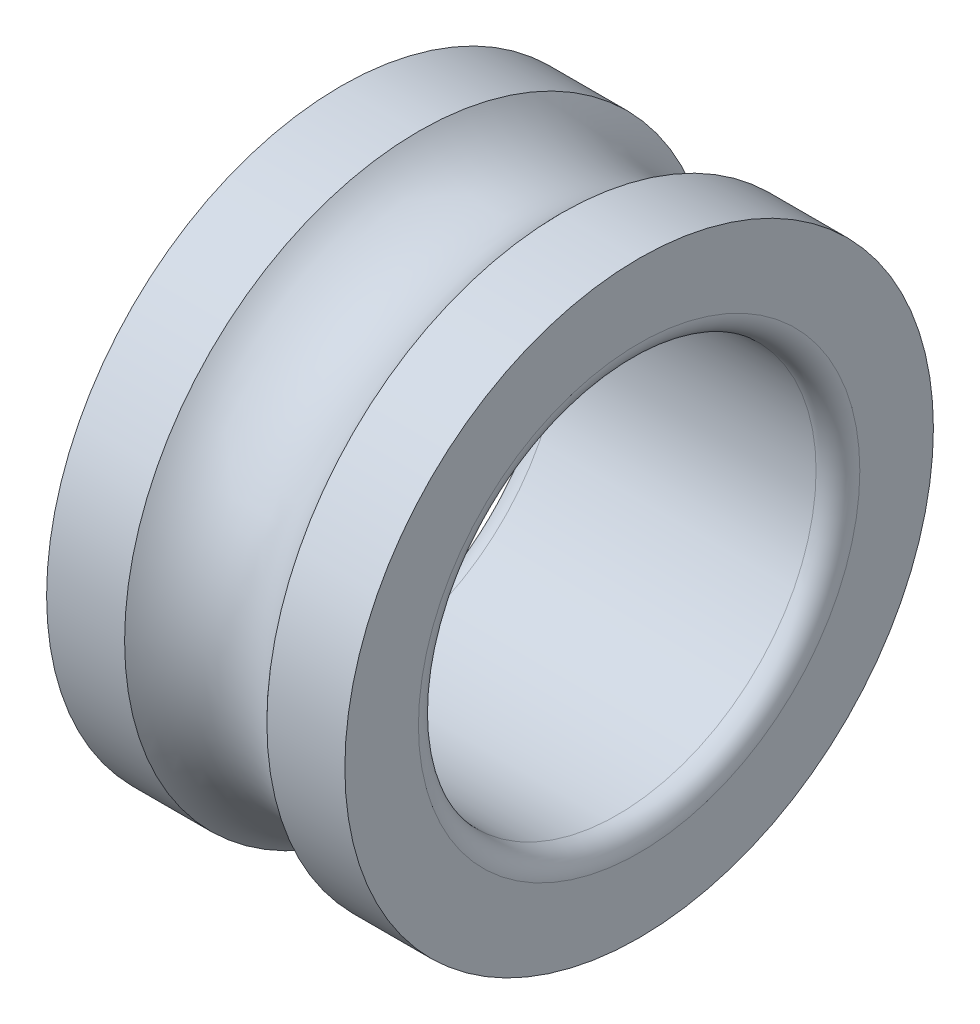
ISO-10303-21;
HEADER;
FILE_DESCRIPTION(('STEP AP214'),'2;1');
FILE_NAME('part.step','',(''),(''),'','','');
FILE_SCHEMA(('AUTOMOTIVE_DESIGN { 1 0 10303 214 1 1 1 1 }'));
ENDSEC;
DATA;
#1=APPLICATION_CONTEXT('core data for automotive mechanical design processes');
#2=APPLICATION_PROTOCOL_DEFINITION('international standard','automotive_design',2000,#1);
#3=PRODUCT_CONTEXT('',#1,'mechanical');
#4=PRODUCT('Part','Part','',(#3));
#5=PRODUCT_RELATED_PRODUCT_CATEGORY('part','',(#4));
#6=PRODUCT_DEFINITION_FORMATION('','',#4);
#7=PRODUCT_DEFINITION_CONTEXT('part definition',#1,'design');
#8=PRODUCT_DEFINITION('design','',#6,#7);
#9=PRODUCT_DEFINITION_SHAPE('','',#8);
#10=(LENGTH_UNIT() NAMED_UNIT(*) SI_UNIT(.MILLI.,.METRE.));
#11=(NAMED_UNIT(*) PLANE_ANGLE_UNIT() SI_UNIT($,.RADIAN.));
#12=(NAMED_UNIT(*) SI_UNIT($,.STERADIAN.) SOLID_ANGLE_UNIT());
#13=UNCERTAINTY_MEASURE_WITH_UNIT(LENGTH_MEASURE(1.E-05),#10,'distance_accuracy_value','');
#14=(GEOMETRIC_REPRESENTATION_CONTEXT(3) GLOBAL_UNCERTAINTY_ASSIGNED_CONTEXT((#13)) GLOBAL_UNIT_ASSIGNED_CONTEXT((#10,
#11,#12)) REPRESENTATION_CONTEXT('',''));
#15=CARTESIAN_POINT('',(0.,0.,0.));
#16=DIRECTION('',(0.,0.,1.));
#17=DIRECTION('',(1.,0.,0.));
#18=AXIS2_PLACEMENT_3D('',#15,#16,#17);
#19=CARTESIAN_POINT('',(1.1,0.,0.));
#20=DIRECTION('',(-1.,0.,0.));
#21=DIRECTION('',(0.,0.,1.));
#22=AXIS2_PLACEMENT_3D('',#19,#20,#21);
#23=TOROIDAL_SURFACE('',#22,11.1,1.1);
#24=CARTESIAN_POINT('',(1.1,0.,0.));
#25=DIRECTION('',(-1.,0.,0.));
#26=DIRECTION('',(0.,0.,1.));
#27=AXIS2_PLACEMENT_3D('',#24,#25,#26);
#28=CIRCLE('',#27,10.);
#29=CARTESIAN_POINT('',(1.1,0.,10.));
#30=VERTEX_POINT('',#29);
#31=EDGE_CURVE('E10',#30,#30,#28,.T.);
#32=ORIENTED_EDGE('',*,*,#31,.F.);
#33=EDGE_LOOP('',(#32));
#34=FACE_BOUND('',#33,.T.);
#35=CARTESIAN_POINT('',(0.,0.,0.));
#36=DIRECTION('',(-1.,0.,0.));
#37=DIRECTION('',(0.,0.,1.));
#38=AXIS2_PLACEMENT_3D('',#35,#36,#37);
#39=CIRCLE('',#38,11.1);
#40=CARTESIAN_POINT('',(0.,0.,11.1));
#41=VERTEX_POINT('',#40);
#42=EDGE_CURVE('E57',#41,#41,#39,.T.);
#43=ORIENTED_EDGE('',*,*,#42,.T.);
#44=EDGE_LOOP('',(#43));
#45=FACE_BOUND('',#44,.T.);
#46=ADVANCED_FACE('F29',(#34,#45),#23,.T.);
#47=CARTESIAN_POINT('',(0.,0.,0.));
#48=DIRECTION('',(-1.,0.,0.));
#49=DIRECTION('',(0.,0.,1.));
#50=AXIS2_PLACEMENT_3D('',#47,#48,#49);
#51=CYLINDRICAL_SURFACE('',#50,10.);
#52=CARTESIAN_POINT('',(13.9,0.,0.));
#53=DIRECTION('',(-1.,0.,0.));
#54=DIRECTION('',(0.,0.,1.));
#55=AXIS2_PLACEMENT_3D('',#52,#53,#54);
#56=CIRCLE('',#55,10.);
#57=CARTESIAN_POINT('',(13.9,0.,10.));
#58=VERTEX_POINT('',#57);
#59=EDGE_CURVE('E35',#58,#58,#56,.T.);
#60=ORIENTED_EDGE('',*,*,#59,.F.);
#61=EDGE_LOOP('',(#60));
#62=FACE_BOUND('',#61,.T.);
#63=ORIENTED_EDGE('',*,*,#31,.T.);
#64=EDGE_LOOP('',(#63));
#65=FACE_BOUND('',#64,.T.);
#66=ADVANCED_FACE('F94',(#62,#65),#51,.F.);
#67=CARTESIAN_POINT('',(13.9,0.,0.));
#68=DIRECTION('',(-1.,0.,0.));
#69=DIRECTION('',(0.,0.,1.));
#70=AXIS2_PLACEMENT_3D('',#67,#68,#69);
#71=TOROIDAL_SURFACE('',#70,11.1,1.1);
#72=CARTESIAN_POINT('',(15.,0.,0.));
#73=DIRECTION('',(-1.,0.,0.));
#74=DIRECTION('',(0.,0.,1.));
#75=AXIS2_PLACEMENT_3D('',#72,#73,#74);
#76=CIRCLE('',#75,11.1);
#77=CARTESIAN_POINT('',(15.,0.,11.1));
#78=VERTEX_POINT('',#77);
#79=EDGE_CURVE('E39',#78,#78,#76,.T.);
#80=ORIENTED_EDGE('',*,*,#79,.F.);
#81=EDGE_LOOP('',(#80));
#82=FACE_BOUND('',#81,.T.);
#83=ORIENTED_EDGE('',*,*,#59,.T.);
#84=EDGE_LOOP('',(#83));
#85=FACE_BOUND('',#84,.T.);
#86=ADVANCED_FACE('F89',(#82,#85),#71,.T.);
#87=CARTESIAN_POINT('',(15.,0.,-14.8));
#88=DIRECTION('',(-1.,0.,0.));
#89=DIRECTION('',(0.,0.,1.));
#90=AXIS2_PLACEMENT_3D('',#87,#88,#89);
#91=PLANE('',#90);
#92=CARTESIAN_POINT('',(15.,0.,0.));
#93=DIRECTION('',(-1.,0.,0.));
#94=DIRECTION('',(0.,0.,1.));
#95=AXIS2_PLACEMENT_3D('',#92,#93,#94);
#96=CIRCLE('',#95,14.8);
#97=CARTESIAN_POINT('',(15.,0.,14.8));
#98=VERTEX_POINT('',#97);
#99=EDGE_CURVE('E43',#98,#98,#96,.T.);
#100=ORIENTED_EDGE('',*,*,#99,.F.);
#101=EDGE_LOOP('',(#100));
#102=FACE_BOUND('',#101,.T.);
#103=ORIENTED_EDGE('',*,*,#79,.T.);
#104=EDGE_LOOP('',(#103));
#105=FACE_BOUND('',#104,.T.);
#106=ADVANCED_FACE('F83',(#102,#105),#91,.F.);
#107=CARTESIAN_POINT('',(0.,0.,0.));
#108=DIRECTION('',(-1.,0.,0.));
#109=DIRECTION('',(0.,0.,1.));
#110=AXIS2_PLACEMENT_3D('',#107,#108,#109);
#111=CYLINDRICAL_SURFACE('',#110,14.8);
#112=CARTESIAN_POINT('',(11.0777087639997,0.,0.));
#113=DIRECTION('',(-1.,0.,0.));
#114=DIRECTION('',(0.,0.,1.));
#115=AXIS2_PLACEMENT_3D('',#112,#113,#114);
#116=CIRCLE('',#115,14.8);
#117=CARTESIAN_POINT('',(11.0777087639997,0.,14.8));
#118=VERTEX_POINT('',#117);
#119=EDGE_CURVE('E48',#118,#118,#116,.T.);
#120=ORIENTED_EDGE('',*,*,#119,.F.);
#121=EDGE_LOOP('',(#120));
#122=FACE_BOUND('',#121,.T.);
#123=ORIENTED_EDGE('',*,*,#99,.T.);
#124=EDGE_LOOP('',(#123));
#125=FACE_BOUND('',#124,.T.);
#126=ADVANCED_FACE('F77',(#122,#125),#111,.T.);
#127=CARTESIAN_POINT('',(7.5,0.,0.));
#128=DIRECTION('',(-1.,0.,0.));
#129=DIRECTION('',(0.,0.,1.));
#130=AXIS2_PLACEMENT_3D('',#127,#128,#129);
#131=TOROIDAL_SURFACE('',#130,18.,4.8);
#132=CARTESIAN_POINT('',(3.92229123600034,0.,0.));
#133=DIRECTION('',(-1.,0.,0.));
#134=DIRECTION('',(0.,0.,1.));
#135=AXIS2_PLACEMENT_3D('',#132,#133,#134);
#136=CIRCLE('',#135,14.8);
#137=CARTESIAN_POINT('',(3.92229123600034,0.,14.8));
#138=VERTEX_POINT('',#137);
#139=EDGE_CURVE('E51',#138,#138,#136,.T.);
#140=ORIENTED_EDGE('',*,*,#139,.F.);
#141=EDGE_LOOP('',(#140));
#142=FACE_BOUND('',#141,.T.);
#143=ORIENTED_EDGE('',*,*,#119,.T.);
#144=EDGE_LOOP('',(#143));
#145=FACE_BOUND('',#144,.T.);
#146=ADVANCED_FACE('F71',(#142,#145),#131,.F.);
#147=CARTESIAN_POINT('',(0.,0.,0.));
#148=DIRECTION('',(-1.,0.,0.));
#149=DIRECTION('',(0.,0.,1.));
#150=AXIS2_PLACEMENT_3D('',#147,#148,#149);
#151=CYLINDRICAL_SURFACE('',#150,14.8);
#152=CARTESIAN_POINT('',(0.,0.,0.));
#153=DIRECTION('',(-1.,0.,0.));
#154=DIRECTION('',(0.,0.,1.));
#155=AXIS2_PLACEMENT_3D('',#152,#153,#154);
#156=CIRCLE('',#155,14.8);
#157=CARTESIAN_POINT('',(0.,0.,14.8));
#158=VERTEX_POINT('',#157);
#159=EDGE_CURVE('E54',#158,#158,#156,.T.);
#160=ORIENTED_EDGE('',*,*,#159,.F.);
#161=EDGE_LOOP('',(#160));
#162=FACE_BOUND('',#161,.T.);
#163=ORIENTED_EDGE('',*,*,#139,.T.);
#164=EDGE_LOOP('',(#163));
#165=FACE_BOUND('',#164,.T.);
#166=ADVANCED_FACE('F65',(#162,#165),#151,.T.);
#167=CARTESIAN_POINT('',(0.,0.,-14.8));
#168=DIRECTION('',(1.,0.,0.));
#169=DIRECTION('',(0.,0.,-1.));
#170=AXIS2_PLACEMENT_3D('',#167,#168,#169);
#171=PLANE('',#170);
#172=ORIENTED_EDGE('',*,*,#42,.F.);
#173=EDGE_LOOP('',(#172));
#174=FACE_BOUND('',#173,.T.);
#175=ORIENTED_EDGE('',*,*,#159,.T.);
#176=EDGE_LOOP('',(#175));
#177=FACE_BOUND('',#176,.T.);
#178=ADVANCED_FACE('F62',(#174,#177),#171,.F.);
#179=CLOSED_SHELL('',(#46,#66,#86,#106,#126,#146,#166,#178));
#180=MANIFOLD_SOLID_BREP('B2',#179);
#181=ADVANCED_BREP_SHAPE_REPRESENTATION('',(#18,#180),#14);
#182=SHAPE_DEFINITION_REPRESENTATION(#9,#181);
ENDSEC;
END-ISO-10303-21;
